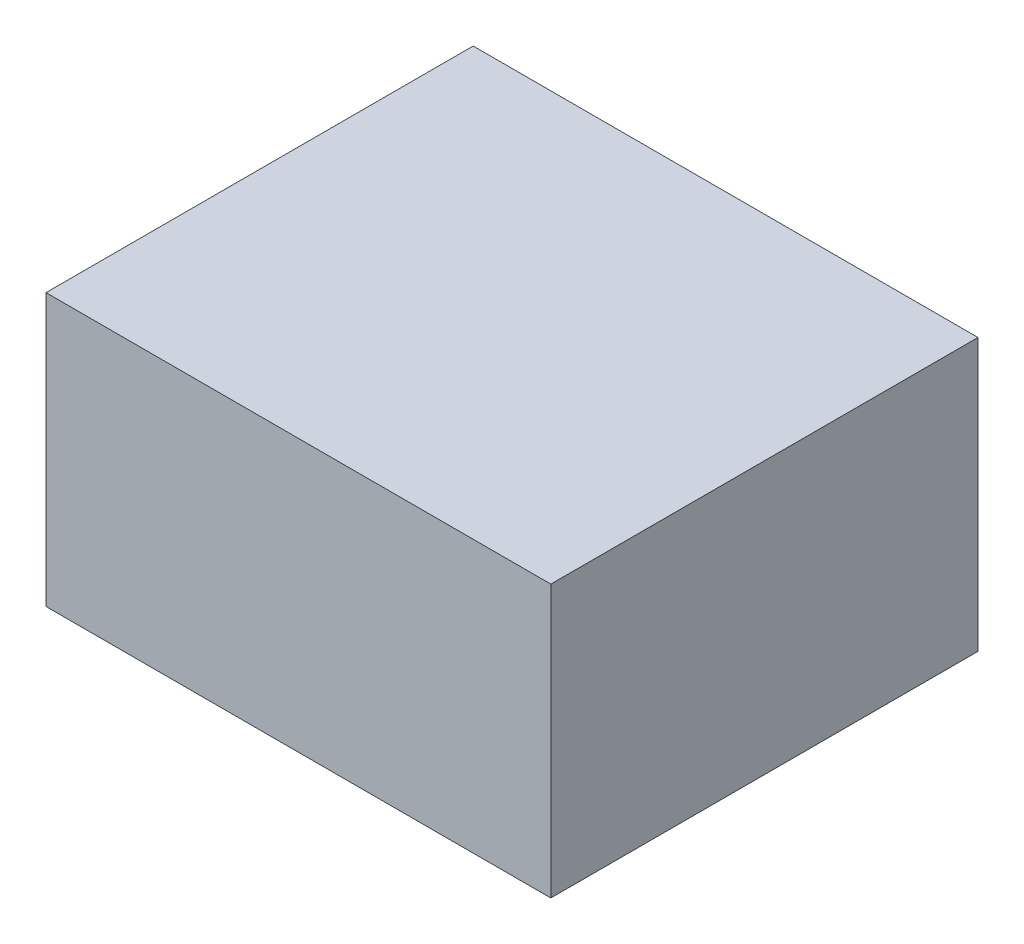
ISO-10303-21;
HEADER;
FILE_DESCRIPTION(('STEP AP214'),'2;1');
FILE_NAME('part.step','',(''),(''),'','','');
FILE_SCHEMA(('AUTOMOTIVE_DESIGN { 1 0 10303 214 1 1 1 1 }'));
ENDSEC;
DATA;
#1=APPLICATION_CONTEXT('core data for automotive mechanical design processes');
#2=APPLICATION_PROTOCOL_DEFINITION('international standard','automotive_design',2000,#1);
#3=PRODUCT_CONTEXT('',#1,'mechanical');
#4=PRODUCT('Part','Part','',(#3));
#5=PRODUCT_RELATED_PRODUCT_CATEGORY('part','',(#4));
#6=PRODUCT_DEFINITION_FORMATION('','',#4);
#7=PRODUCT_DEFINITION_CONTEXT('part definition',#1,'design');
#8=PRODUCT_DEFINITION('design','',#6,#7);
#9=PRODUCT_DEFINITION_SHAPE('','',#8);
#10=(LENGTH_UNIT() NAMED_UNIT(*) SI_UNIT(.MILLI.,.METRE.));
#11=(NAMED_UNIT(*) PLANE_ANGLE_UNIT() SI_UNIT($,.RADIAN.));
#12=(NAMED_UNIT(*) SI_UNIT($,.STERADIAN.) SOLID_ANGLE_UNIT());
#13=UNCERTAINTY_MEASURE_WITH_UNIT(LENGTH_MEASURE(1.E-05),#10,'distance_accuracy_value','');
#14=(GEOMETRIC_REPRESENTATION_CONTEXT(3) GLOBAL_UNCERTAINTY_ASSIGNED_CONTEXT((#13)) GLOBAL_UNIT_ASSIGNED_CONTEXT((#10,
#11,#12)) REPRESENTATION_CONTEXT('',''));
#15=CARTESIAN_POINT('',(0.,0.,0.));
#16=DIRECTION('',(0.,0.,1.));
#17=DIRECTION('',(1.,0.,0.));
#18=AXIS2_PLACEMENT_3D('',#15,#16,#17);
#19=CARTESIAN_POINT('',(0.,1.270000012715E-06,0.5499989));
#20=DIRECTION('',(0.,0.,1.));
#21=DIRECTION('',(1.,0.,0.));
#22=AXIS2_PLACEMENT_3D('',#19,#20,#21);
#23=PLANE('',#22);
#24=DIRECTION('',(0.,1.,0.));
#25=VECTOR('',#24,1.);
#26=CARTESIAN_POINT('',(0.32500062,-0.17499838,0.5499989));
#27=LINE('',#26,#25);
#28=CARTESIAN_POINT('',(0.32500062,-0.17499838,0.5499989));
#29=VERTEX_POINT('',#28);
#30=CARTESIAN_POINT('',(0.32500062,0.17500092,0.5499989));
#31=VERTEX_POINT('',#30);
#32=EDGE_CURVE('E82',#29,#31,#27,.T.);
#33=ORIENTED_EDGE('',*,*,#32,.T.);
#34=DIRECTION('',(-1.,0.,0.));
#35=VECTOR('',#34,1.);
#36=CARTESIAN_POINT('',(0.32500062,0.17500092,0.5499989));
#37=LINE('',#36,#35);
#38=CARTESIAN_POINT('',(-0.32500062,0.17500092,0.5499989));
#39=VERTEX_POINT('',#38);
#40=EDGE_CURVE('E109',#31,#39,#37,.T.);
#41=ORIENTED_EDGE('',*,*,#40,.T.);
#42=DIRECTION('',(0.,-1.,0.));
#43=VECTOR('',#42,1.);
#44=CARTESIAN_POINT('',(-0.32500062,0.17500092,0.5499989));
#45=LINE('',#44,#43);
#46=CARTESIAN_POINT('',(-0.32500062,-0.17499838,0.5499989));
#47=VERTEX_POINT('',#46);
#48=EDGE_CURVE('E75',#39,#47,#45,.T.);
#49=ORIENTED_EDGE('',*,*,#48,.T.);
#50=DIRECTION('',(1.,0.,0.));
#51=VECTOR('',#50,1.);
#52=CARTESIAN_POINT('',(-0.32500062,-0.17499838,0.5499989));
#53=LINE('',#52,#51);
#54=EDGE_CURVE('E11',#47,#29,#53,.T.);
#55=ORIENTED_EDGE('',*,*,#54,.T.);
#56=EDGE_LOOP('',(#33,#41,#49,#55));
#57=FACE_BOUND('',#56,.T.);
#58=ADVANCED_FACE('F17',(#57),#23,.T.);
#59=CARTESIAN_POINT('',(0.,1.270000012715E-06,0.));
#60=DIRECTION('',(0.,0.,1.));
#61=DIRECTION('',(1.,0.,0.));
#62=AXIS2_PLACEMENT_3D('',#59,#60,#61);
#63=PLANE('',#62);
#64=DIRECTION('',(1.,0.,0.));
#65=VECTOR('',#64,1.);
#66=CARTESIAN_POINT('',(-0.32500062,-0.17499838,0.));
#67=LINE('',#66,#65);
#68=CARTESIAN_POINT('',(-0.32500062,-0.17499838,0.));
#69=VERTEX_POINT('',#68);
#70=CARTESIAN_POINT('',(0.32500062,-0.17499838,0.));
#71=VERTEX_POINT('',#70);
#72=EDGE_CURVE('E20',#69,#71,#67,.T.);
#73=ORIENTED_EDGE('',*,*,#72,.F.);
#74=DIRECTION('',(0.,-1.,0.));
#75=VECTOR('',#74,1.);
#76=CARTESIAN_POINT('',(-0.32500062,0.17500092,0.));
#77=LINE('',#76,#75);
#78=CARTESIAN_POINT('',(-0.32500062,0.17500092,0.));
#79=VERTEX_POINT('',#78);
#80=EDGE_CURVE('E101',#79,#69,#77,.T.);
#81=ORIENTED_EDGE('',*,*,#80,.F.);
#82=DIRECTION('',(-1.,0.,0.));
#83=VECTOR('',#82,1.);
#84=CARTESIAN_POINT('',(0.32500062,0.17500092,0.));
#85=LINE('',#84,#83);
#86=CARTESIAN_POINT('',(0.32500062,0.17500092,0.));
#87=VERTEX_POINT('',#86);
#88=EDGE_CURVE('E84',#87,#79,#85,.T.);
#89=ORIENTED_EDGE('',*,*,#88,.F.);
#90=DIRECTION('',(0.,1.,0.));
#91=VECTOR('',#90,1.);
#92=CARTESIAN_POINT('',(0.32500062,-0.17499838,0.));
#93=LINE('',#92,#91);
#94=EDGE_CURVE('E80',#71,#87,#93,.T.);
#95=ORIENTED_EDGE('',*,*,#94,.F.);
#96=EDGE_LOOP('',(#73,#81,#89,#95));
#97=FACE_BOUND('',#96,.T.);
#98=ADVANCED_FACE('F86',(#97),#63,.F.);
#99=CARTESIAN_POINT('',(-0.32500062,-0.17499838,0.));
#100=DIRECTION('',(0.,1.,0.));
#101=DIRECTION('',(1.,0.,0.));
#102=AXIS2_PLACEMENT_3D('',#99,#100,#101);
#103=PLANE('',#102);
#104=ORIENTED_EDGE('',*,*,#72,.T.);
#105=DIRECTION('',(0.,0.,1.));
#106=VECTOR('',#105,1.);
#107=CARTESIAN_POINT('',(0.32500062,-0.17499838,0.));
#108=LINE('',#107,#106);
#109=EDGE_CURVE('E69',#71,#29,#108,.T.);
#110=ORIENTED_EDGE('',*,*,#109,.T.);
#111=ORIENTED_EDGE('',*,*,#54,.F.);
#112=DIRECTION('',(0.,0.,1.));
#113=VECTOR('',#112,1.);
#114=CARTESIAN_POINT('',(-0.32500062,-0.17499838,0.));
#115=LINE('',#114,#113);
#116=EDGE_CURVE('E72',#69,#47,#115,.T.);
#117=ORIENTED_EDGE('',*,*,#116,.F.);
#118=EDGE_LOOP('',(#104,#110,#111,#117));
#119=FACE_BOUND('',#118,.T.);
#120=ADVANCED_FACE('F68',(#119),#103,.F.);
#121=CARTESIAN_POINT('',(-0.32500062,0.17500092,0.));
#122=DIRECTION('',(1.,0.,0.));
#123=DIRECTION('',(0.,1.,0.));
#124=AXIS2_PLACEMENT_3D('',#121,#122,#123);
#125=PLANE('',#124);
#126=ORIENTED_EDGE('',*,*,#80,.T.);
#127=ORIENTED_EDGE('',*,*,#116,.T.);
#128=ORIENTED_EDGE('',*,*,#48,.F.);
#129=DIRECTION('',(0.,0.,1.));
#130=VECTOR('',#129,1.);
#131=CARTESIAN_POINT('',(-0.32500062,0.17500092,0.));
#132=LINE('',#131,#130);
#133=EDGE_CURVE('E105',#79,#39,#132,.T.);
#134=ORIENTED_EDGE('',*,*,#133,.F.);
#135=EDGE_LOOP('',(#126,#127,#128,#134));
#136=FACE_BOUND('',#135,.T.);
#137=ADVANCED_FACE('F120',(#136),#125,.F.);
#138=CARTESIAN_POINT('',(0.32500062,0.17500092,0.));
#139=DIRECTION('',(0.,-1.,0.));
#140=DIRECTION('',(0.,0.,-1.));
#141=AXIS2_PLACEMENT_3D('',#138,#139,#140);
#142=PLANE('',#141);
#143=ORIENTED_EDGE('',*,*,#88,.T.);
#144=ORIENTED_EDGE('',*,*,#133,.T.);
#145=ORIENTED_EDGE('',*,*,#40,.F.);
#146=DIRECTION('',(0.,0.,1.));
#147=VECTOR('',#146,1.);
#148=CARTESIAN_POINT('',(0.32500062,0.17500092,0.));
#149=LINE('',#148,#147);
#150=EDGE_CURVE('E90',#87,#31,#149,.T.);
#151=ORIENTED_EDGE('',*,*,#150,.F.);
#152=EDGE_LOOP('',(#143,#144,#145,#151));
#153=FACE_BOUND('',#152,.T.);
#154=ADVANCED_FACE('F122',(#153),#142,.F.);
#155=CARTESIAN_POINT('',(0.32500062,-0.17499838,0.));
#156=DIRECTION('',(-1.,0.,0.));
#157=DIRECTION('',(0.,0.,1.));
#158=AXIS2_PLACEMENT_3D('',#155,#156,#157);
#159=PLANE('',#158);
#160=ORIENTED_EDGE('',*,*,#94,.T.);
#161=ORIENTED_EDGE('',*,*,#150,.T.);
#162=ORIENTED_EDGE('',*,*,#32,.F.);
#163=ORIENTED_EDGE('',*,*,#109,.F.);
#164=EDGE_LOOP('',(#160,#161,#162,#163));
#165=FACE_BOUND('',#164,.T.);
#166=ADVANCED_FACE('F78',(#165),#159,.F.);
#167=CLOSED_SHELL('',(#58,#98,#120,#137,#154,#166));
#168=MANIFOLD_SOLID_BREP('B1',#167);
#169=ADVANCED_BREP_SHAPE_REPRESENTATION('',(#18,#168),#14);
#170=SHAPE_DEFINITION_REPRESENTATION(#9,#169);
ENDSEC;
END-ISO-10303-21;
